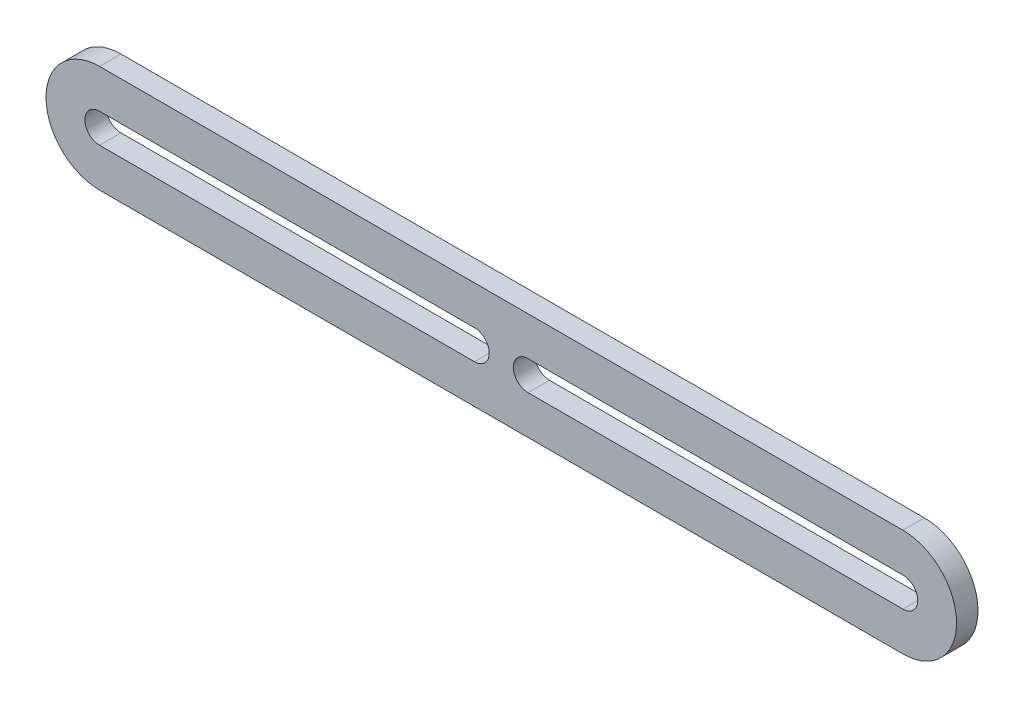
ISO-10303-21;
HEADER;
FILE_DESCRIPTION(('STEP AP214'),'2;1');
FILE_NAME('part.step','',(''),(''),'','','');
FILE_SCHEMA(('AUTOMOTIVE_DESIGN { 1 0 10303 214 1 1 1 1 }'));
ENDSEC;
DATA;
#1=APPLICATION_CONTEXT('core data for automotive mechanical design processes');
#2=APPLICATION_PROTOCOL_DEFINITION('international standard','automotive_design',2000,#1);
#3=PRODUCT_CONTEXT('',#1,'mechanical');
#4=PRODUCT('Part','Part','',(#3));
#5=PRODUCT_RELATED_PRODUCT_CATEGORY('part','',(#4));
#6=PRODUCT_DEFINITION_FORMATION('','',#4);
#7=PRODUCT_DEFINITION_CONTEXT('part definition',#1,'design');
#8=PRODUCT_DEFINITION('design','',#6,#7);
#9=PRODUCT_DEFINITION_SHAPE('','',#8);
#10=(LENGTH_UNIT() NAMED_UNIT(*) SI_UNIT(.MILLI.,.METRE.));
#11=(NAMED_UNIT(*) PLANE_ANGLE_UNIT() SI_UNIT($,.RADIAN.));
#12=(NAMED_UNIT(*) SI_UNIT($,.STERADIAN.) SOLID_ANGLE_UNIT());
#13=UNCERTAINTY_MEASURE_WITH_UNIT(LENGTH_MEASURE(1.E-05),#10,'distance_accuracy_value','');
#14=(GEOMETRIC_REPRESENTATION_CONTEXT(3) GLOBAL_UNCERTAINTY_ASSIGNED_CONTEXT((#13)) GLOBAL_UNIT_ASSIGNED_CONTEXT((#10,
#11,#12)) REPRESENTATION_CONTEXT('',''));
#15=CARTESIAN_POINT('',(0.,0.,0.));
#16=DIRECTION('',(0.,0.,1.));
#17=DIRECTION('',(1.,0.,0.));
#18=AXIS2_PLACEMENT_3D('',#15,#16,#17);
#19=CARTESIAN_POINT('',(0.,10.,4.));
#20=DIRECTION('',(0.,0.,-1.));
#21=DIRECTION('',(-1.,0.,0.));
#22=AXIS2_PLACEMENT_3D('',#19,#20,#21);
#23=PLANE('',#22);
#24=CARTESIAN_POINT('',(0.,10.,4.));
#25=DIRECTION('',(0.,0.,1.));
#26=DIRECTION('',(1.,0.,0.));
#27=AXIS2_PLACEMENT_3D('',#24,#25,#26);
#28=CIRCLE('',#27,2.75);
#29=CARTESIAN_POINT('',(0.,12.75,4.));
#30=VERTEX_POINT('',#29);
#31=CARTESIAN_POINT('',(0.,7.25,4.));
#32=VERTEX_POINT('',#31);
#33=EDGE_CURVE('E180',#30,#32,#28,.T.);
#34=ORIENTED_EDGE('',*,*,#33,.F.);
#35=DIRECTION('',(-1.,0.,0.));
#36=VECTOR('',#35,1.);
#37=CARTESIAN_POINT('',(0.,12.75,4.));
#38=LINE('',#37,#36);
#39=CARTESIAN_POINT('',(70.,12.75,4.));
#40=VERTEX_POINT('',#39);
#41=EDGE_CURVE('E191',#40,#30,#38,.T.);
#42=ORIENTED_EDGE('',*,*,#41,.F.);
#43=CARTESIAN_POINT('',(70.,10.,4.));
#44=DIRECTION('',(0.,0.,1.));
#45=DIRECTION('',(1.,0.,0.));
#46=AXIS2_PLACEMENT_3D('',#43,#44,#45);
#47=CIRCLE('',#46,2.74999999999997);
#48=CARTESIAN_POINT('',(70.,7.25000000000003,4.));
#49=VERTEX_POINT('',#48);
#50=EDGE_CURVE('E187',#49,#40,#47,.T.);
#51=ORIENTED_EDGE('',*,*,#50,.F.);
#52=DIRECTION('',(1.,0.,0.));
#53=VECTOR('',#52,1.);
#54=CARTESIAN_POINT('',(0.,7.25,4.));
#55=LINE('',#54,#53);
#56=EDGE_CURVE('E183',#32,#49,#55,.T.);
#57=ORIENTED_EDGE('',*,*,#56,.F.);
#58=EDGE_LOOP('',(#34,#42,#51,#57));
#59=FACE_BOUND('',#58,.T.);
#60=CARTESIAN_POINT('',(0.,10.,4.));
#61=DIRECTION('',(0.,0.,1.));
#62=DIRECTION('',(-1.,0.,0.));
#63=AXIS2_PLACEMENT_3D('',#60,#61,#62);
#64=CIRCLE('',#63,10.);
#65=CARTESIAN_POINT('',(0.,20.,4.));
#66=VERTEX_POINT('',#65);
#67=CARTESIAN_POINT('',(0.,0.,4.));
#68=VERTEX_POINT('',#67);
#69=EDGE_CURVE('E223',#66,#68,#64,.T.);
#70=ORIENTED_EDGE('',*,*,#69,.T.);
#71=DIRECTION('',(1.,0.,0.));
#72=VECTOR('',#71,1.);
#73=CARTESIAN_POINT('',(0.,0.,4.));
#74=LINE('',#73,#72);
#75=CARTESIAN_POINT('',(150.,0.,4.));
#76=VERTEX_POINT('',#75);
#77=EDGE_CURVE('E227',#68,#76,#74,.T.);
#78=ORIENTED_EDGE('',*,*,#77,.T.);
#79=CARTESIAN_POINT('',(150.,10.,4.));
#80=DIRECTION('',(0.,0.,1.));
#81=DIRECTION('',(-1.,0.,0.));
#82=AXIS2_PLACEMENT_3D('',#79,#80,#81);
#83=CIRCLE('',#82,10.);
#84=CARTESIAN_POINT('',(150.,20.,4.));
#85=VERTEX_POINT('',#84);
#86=EDGE_CURVE('E231',#76,#85,#83,.T.);
#87=ORIENTED_EDGE('',*,*,#86,.T.);
#88=DIRECTION('',(-1.,0.,0.));
#89=VECTOR('',#88,1.);
#90=CARTESIAN_POINT('',(0.,20.,4.));
#91=LINE('',#90,#89);
#92=EDGE_CURVE('E234',#85,#66,#91,.T.);
#93=ORIENTED_EDGE('',*,*,#92,.T.);
#94=EDGE_LOOP('',(#70,#78,#87,#93));
#95=FACE_BOUND('',#94,.T.);
#96=CARTESIAN_POINT('',(150.,10.,4.));
#97=DIRECTION('',(0.,0.,1.));
#98=DIRECTION('',(-1.,0.,0.));
#99=AXIS2_PLACEMENT_3D('',#96,#97,#98);
#100=CIRCLE('',#99,2.74999999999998);
#101=CARTESIAN_POINT('',(150.,7.25000000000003,4.));
#102=VERTEX_POINT('',#101);
#103=CARTESIAN_POINT('',(150.,12.75,4.));
#104=VERTEX_POINT('',#103);
#105=EDGE_CURVE('E132',#102,#104,#100,.T.);
#106=ORIENTED_EDGE('',*,*,#105,.F.);
#107=DIRECTION('',(1.,0.,0.));
#108=VECTOR('',#107,1.);
#109=CARTESIAN_POINT('',(150.,7.25000000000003,4.));
#110=LINE('',#109,#108);
#111=CARTESIAN_POINT('',(80.,7.25000000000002,4.));
#112=VERTEX_POINT('',#111);
#113=EDGE_CURVE('E158',#112,#102,#110,.T.);
#114=ORIENTED_EDGE('',*,*,#113,.F.);
#115=CARTESIAN_POINT('',(80.,10.,4.));
#116=DIRECTION('',(0.,0.,1.));
#117=DIRECTION('',(-1.,0.,0.));
#118=AXIS2_PLACEMENT_3D('',#115,#116,#117);
#119=CIRCLE('',#118,2.74999999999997);
#120=CARTESIAN_POINT('',(80.,12.75,4.));
#121=VERTEX_POINT('',#120);
#122=EDGE_CURVE('E154',#121,#112,#119,.T.);
#123=ORIENTED_EDGE('',*,*,#122,.F.);
#124=DIRECTION('',(-1.,0.,0.));
#125=VECTOR('',#124,1.);
#126=CARTESIAN_POINT('',(150.,12.75,4.));
#127=LINE('',#126,#125);
#128=EDGE_CURVE('E141',#104,#121,#127,.T.);
#129=ORIENTED_EDGE('',*,*,#128,.F.);
#130=EDGE_LOOP('',(#106,#114,#123,#129));
#131=FACE_BOUND('',#130,.T.);
#132=ADVANCED_FACE('F42',(#59,#95,#131),#23,.F.);
#133=CARTESIAN_POINT('',(0.,10.,0.));
#134=DIRECTION('',(0.,0.,-1.));
#135=DIRECTION('',(-1.,0.,0.));
#136=AXIS2_PLACEMENT_3D('',#133,#134,#135);
#137=PLANE('',#136);
#138=CARTESIAN_POINT('',(0.,10.,0.));
#139=DIRECTION('',(0.,0.,1.));
#140=DIRECTION('',(-1.,0.,0.));
#141=AXIS2_PLACEMENT_3D('',#138,#139,#140);
#142=CIRCLE('',#141,10.);
#143=CARTESIAN_POINT('',(0.,20.,0.));
#144=VERTEX_POINT('',#143);
#145=CARTESIAN_POINT('',(0.,0.,0.));
#146=VERTEX_POINT('',#145);
#147=EDGE_CURVE('E222',#144,#146,#142,.T.);
#148=ORIENTED_EDGE('',*,*,#147,.F.);
#149=DIRECTION('',(-1.,0.,0.));
#150=VECTOR('',#149,1.);
#151=CARTESIAN_POINT('',(0.,20.,0.));
#152=LINE('',#151,#150);
#153=CARTESIAN_POINT('',(150.,20.,0.));
#154=VERTEX_POINT('',#153);
#155=EDGE_CURVE('E228',#154,#144,#152,.T.);
#156=ORIENTED_EDGE('',*,*,#155,.F.);
#157=CARTESIAN_POINT('',(150.,10.,0.));
#158=DIRECTION('',(0.,0.,1.));
#159=DIRECTION('',(-1.,0.,0.));
#160=AXIS2_PLACEMENT_3D('',#157,#158,#159);
#161=CIRCLE('',#160,10.);
#162=CARTESIAN_POINT('',(150.,0.,0.));
#163=VERTEX_POINT('',#162);
#164=EDGE_CURVE('E244',#163,#154,#161,.T.);
#165=ORIENTED_EDGE('',*,*,#164,.F.);
#166=DIRECTION('',(1.,0.,0.));
#167=VECTOR('',#166,1.);
#168=CARTESIAN_POINT('',(0.,0.,0.));
#169=LINE('',#168,#167);
#170=EDGE_CURVE('E241',#146,#163,#169,.T.);
#171=ORIENTED_EDGE('',*,*,#170,.F.);
#172=EDGE_LOOP('',(#148,#156,#165,#171));
#173=FACE_BOUND('',#172,.T.);
#174=DIRECTION('',(-1.,0.,0.));
#175=VECTOR('',#174,1.);
#176=CARTESIAN_POINT('',(0.,12.75,0.));
#177=LINE('',#176,#175);
#178=CARTESIAN_POINT('',(70.,12.75,0.));
#179=VERTEX_POINT('',#178);
#180=CARTESIAN_POINT('',(0.,12.75,0.));
#181=VERTEX_POINT('',#180);
#182=EDGE_CURVE('E184',#179,#181,#177,.T.);
#183=ORIENTED_EDGE('',*,*,#182,.T.);
#184=CARTESIAN_POINT('',(0.,10.,0.));
#185=DIRECTION('',(0.,0.,1.));
#186=DIRECTION('',(1.,0.,0.));
#187=AXIS2_PLACEMENT_3D('',#184,#185,#186);
#188=CIRCLE('',#187,2.75);
#189=CARTESIAN_POINT('',(0.,7.25,0.));
#190=VERTEX_POINT('',#189);
#191=EDGE_CURVE('E150',#181,#190,#188,.T.);
#192=ORIENTED_EDGE('',*,*,#191,.T.);
#193=DIRECTION('',(1.,0.,0.));
#194=VECTOR('',#193,1.);
#195=CARTESIAN_POINT('',(0.,7.25,0.));
#196=LINE('',#195,#194);
#197=CARTESIAN_POINT('',(70.,7.25000000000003,0.));
#198=VERTEX_POINT('',#197);
#199=EDGE_CURVE('E198',#190,#198,#196,.T.);
#200=ORIENTED_EDGE('',*,*,#199,.T.);
#201=CARTESIAN_POINT('',(70.,10.,0.));
#202=DIRECTION('',(0.,0.,1.));
#203=DIRECTION('',(1.,0.,0.));
#204=AXIS2_PLACEMENT_3D('',#201,#202,#203);
#205=CIRCLE('',#204,2.74999999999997);
#206=EDGE_CURVE('E202',#198,#179,#205,.T.);
#207=ORIENTED_EDGE('',*,*,#206,.T.);
#208=EDGE_LOOP('',(#183,#192,#200,#207));
#209=FACE_BOUND('',#208,.T.);
#210=DIRECTION('',(1.,0.,0.));
#211=VECTOR('',#210,1.);
#212=CARTESIAN_POINT('',(150.,7.25000000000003,0.));
#213=LINE('',#212,#211);
#214=CARTESIAN_POINT('',(80.,7.25000000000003,0.));
#215=VERTEX_POINT('',#214);
#216=CARTESIAN_POINT('',(150.,7.25000000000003,0.));
#217=VERTEX_POINT('',#216);
#218=EDGE_CURVE('E142',#215,#217,#213,.T.);
#219=ORIENTED_EDGE('',*,*,#218,.T.);
#220=CARTESIAN_POINT('',(150.,10.,0.));
#221=DIRECTION('',(0.,0.,1.));
#222=DIRECTION('',(-1.,0.,0.));
#223=AXIS2_PLACEMENT_3D('',#220,#221,#222);
#224=CIRCLE('',#223,2.74999999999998);
#225=CARTESIAN_POINT('',(150.,12.75,0.));
#226=VERTEX_POINT('',#225);
#227=EDGE_CURVE('E66',#217,#226,#224,.T.);
#228=ORIENTED_EDGE('',*,*,#227,.T.);
#229=DIRECTION('',(-1.,0.,0.));
#230=VECTOR('',#229,1.);
#231=CARTESIAN_POINT('',(150.,12.75,0.));
#232=LINE('',#231,#230);
#233=CARTESIAN_POINT('',(80.,12.75,0.));
#234=VERTEX_POINT('',#233);
#235=EDGE_CURVE('E148',#226,#234,#232,.T.);
#236=ORIENTED_EDGE('',*,*,#235,.T.);
#237=CARTESIAN_POINT('',(80.,10.,0.));
#238=DIRECTION('',(0.,0.,1.));
#239=DIRECTION('',(-1.,0.,0.));
#240=AXIS2_PLACEMENT_3D('',#237,#238,#239);
#241=CIRCLE('',#240,2.74999999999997);
#242=EDGE_CURVE('E167',#234,#215,#241,.T.);
#243=ORIENTED_EDGE('',*,*,#242,.T.);
#244=EDGE_LOOP('',(#219,#228,#236,#243));
#245=FACE_BOUND('',#244,.T.);
#246=ADVANCED_FACE('F267',(#173,#209,#245),#137,.T.);
#247=CARTESIAN_POINT('',(0.,10.,4.));
#248=DIRECTION('',(0.,0.,-1.));
#249=DIRECTION('',(-1.,0.,0.));
#250=AXIS2_PLACEMENT_3D('',#247,#248,#249);
#251=CYLINDRICAL_SURFACE('',#250,10.);
#252=ORIENTED_EDGE('',*,*,#147,.T.);
#253=DIRECTION('',(0.,0.,-1.));
#254=VECTOR('',#253,1.);
#255=CARTESIAN_POINT('',(0.,0.,4.));
#256=LINE('',#255,#254);
#257=EDGE_CURVE('E11',#68,#146,#256,.T.);
#258=ORIENTED_EDGE('',*,*,#257,.F.);
#259=ORIENTED_EDGE('',*,*,#69,.F.);
#260=DIRECTION('',(0.,0.,-1.));
#261=VECTOR('',#260,1.);
#262=CARTESIAN_POINT('',(0.,20.,4.));
#263=LINE('',#262,#261);
#264=EDGE_CURVE('E237',#66,#144,#263,.T.);
#265=ORIENTED_EDGE('',*,*,#264,.T.);
#266=EDGE_LOOP('',(#252,#258,#259,#265));
#267=FACE_BOUND('',#266,.T.);
#268=ADVANCED_FACE('F44',(#267),#251,.T.);
#269=CARTESIAN_POINT('',(0.,0.,4.));
#270=DIRECTION('',(0.,1.,0.));
#271=DIRECTION('',(0.,0.,1.));
#272=AXIS2_PLACEMENT_3D('',#269,#270,#271);
#273=PLANE('',#272);
#274=ORIENTED_EDGE('',*,*,#170,.T.);
#275=DIRECTION('',(0.,0.,-1.));
#276=VECTOR('',#275,1.);
#277=CARTESIAN_POINT('',(150.,0.,4.));
#278=LINE('',#277,#276);
#279=EDGE_CURVE('E51',#76,#163,#278,.T.);
#280=ORIENTED_EDGE('',*,*,#279,.F.);
#281=ORIENTED_EDGE('',*,*,#77,.F.);
#282=ORIENTED_EDGE('',*,*,#257,.T.);
#283=EDGE_LOOP('',(#274,#280,#281,#282));
#284=FACE_BOUND('',#283,.T.);
#285=ADVANCED_FACE('F277',(#284),#273,.F.);
#286=CARTESIAN_POINT('',(150.,10.,4.));
#287=DIRECTION('',(0.,0.,-1.));
#288=DIRECTION('',(-1.,0.,0.));
#289=AXIS2_PLACEMENT_3D('',#286,#287,#288);
#290=CYLINDRICAL_SURFACE('',#289,10.);
#291=ORIENTED_EDGE('',*,*,#164,.T.);
#292=DIRECTION('',(0.,0.,-1.));
#293=VECTOR('',#292,1.);
#294=CARTESIAN_POINT('',(150.,20.,4.));
#295=LINE('',#294,#293);
#296=EDGE_CURVE('E252',#85,#154,#295,.T.);
#297=ORIENTED_EDGE('',*,*,#296,.F.);
#298=ORIENTED_EDGE('',*,*,#86,.F.);
#299=ORIENTED_EDGE('',*,*,#279,.T.);
#300=EDGE_LOOP('',(#291,#297,#298,#299));
#301=FACE_BOUND('',#300,.T.);
#302=ADVANCED_FACE('F261',(#301),#290,.T.);
#303=CARTESIAN_POINT('',(0.,20.,4.));
#304=DIRECTION('',(0.,-1.,0.));
#305=DIRECTION('',(1.,0.,0.));
#306=AXIS2_PLACEMENT_3D('',#303,#304,#305);
#307=PLANE('',#306);
#308=ORIENTED_EDGE('',*,*,#155,.T.);
#309=ORIENTED_EDGE('',*,*,#264,.F.);
#310=ORIENTED_EDGE('',*,*,#92,.F.);
#311=ORIENTED_EDGE('',*,*,#296,.T.);
#312=EDGE_LOOP('',(#308,#309,#310,#311));
#313=FACE_BOUND('',#312,.T.);
#314=ADVANCED_FACE('F271',(#313),#307,.F.);
#315=CARTESIAN_POINT('',(0.,10.,4.));
#316=DIRECTION('',(0.,0.,-1.));
#317=DIRECTION('',(-1.,0.,0.));
#318=AXIS2_PLACEMENT_3D('',#315,#316,#317);
#319=CYLINDRICAL_SURFACE('',#318,2.75);
#320=ORIENTED_EDGE('',*,*,#191,.F.);
#321=DIRECTION('',(0.,0.,-1.));
#322=VECTOR('',#321,1.);
#323=CARTESIAN_POINT('',(0.,12.75,4.));
#324=LINE('',#323,#322);
#325=EDGE_CURVE('E194',#30,#181,#324,.T.);
#326=ORIENTED_EDGE('',*,*,#325,.F.);
#327=ORIENTED_EDGE('',*,*,#33,.T.);
#328=DIRECTION('',(0.,0.,-1.));
#329=VECTOR('',#328,1.);
#330=CARTESIAN_POINT('',(0.,7.25,4.));
#331=LINE('',#330,#329);
#332=EDGE_CURVE('E218',#32,#190,#331,.T.);
#333=ORIENTED_EDGE('',*,*,#332,.T.);
#334=EDGE_LOOP('',(#320,#326,#327,#333));
#335=FACE_BOUND('',#334,.T.);
#336=ADVANCED_FACE('F293',(#335),#319,.F.);
#337=CARTESIAN_POINT('',(0.,7.25,4.));
#338=DIRECTION('',(0.,1.,0.));
#339=DIRECTION('',(-1.,0.,0.));
#340=AXIS2_PLACEMENT_3D('',#337,#338,#339);
#341=PLANE('',#340);
#342=ORIENTED_EDGE('',*,*,#199,.F.);
#343=ORIENTED_EDGE('',*,*,#332,.F.);
#344=ORIENTED_EDGE('',*,*,#56,.T.);
#345=DIRECTION('',(0.,0.,-1.));
#346=VECTOR('',#345,1.);
#347=CARTESIAN_POINT('',(70.,7.25000000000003,4.));
#348=LINE('',#347,#346);
#349=EDGE_CURVE('E215',#49,#198,#348,.T.);
#350=ORIENTED_EDGE('',*,*,#349,.T.);
#351=EDGE_LOOP('',(#342,#343,#344,#350));
#352=FACE_BOUND('',#351,.T.);
#353=ADVANCED_FACE('F300',(#352),#341,.T.);
#354=CARTESIAN_POINT('',(70.,10.,4.));
#355=DIRECTION('',(0.,0.,-1.));
#356=DIRECTION('',(-1.,0.,0.));
#357=AXIS2_PLACEMENT_3D('',#354,#355,#356);
#358=CYLINDRICAL_SURFACE('',#357,2.74999999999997);
#359=ORIENTED_EDGE('',*,*,#206,.F.);
#360=ORIENTED_EDGE('',*,*,#349,.F.);
#361=ORIENTED_EDGE('',*,*,#50,.T.);
#362=DIRECTION('',(0.,0.,-1.));
#363=VECTOR('',#362,1.);
#364=CARTESIAN_POINT('',(70.,12.75,4.));
#365=LINE('',#364,#363);
#366=EDGE_CURVE('E212',#40,#179,#365,.T.);
#367=ORIENTED_EDGE('',*,*,#366,.T.);
#368=EDGE_LOOP('',(#359,#360,#361,#367));
#369=FACE_BOUND('',#368,.T.);
#370=ADVANCED_FACE('F305',(#369),#358,.F.);
#371=CARTESIAN_POINT('',(0.,12.75,4.));
#372=DIRECTION('',(0.,-1.,0.));
#373=DIRECTION('',(1.,0.,0.));
#374=AXIS2_PLACEMENT_3D('',#371,#372,#373);
#375=PLANE('',#374);
#376=ORIENTED_EDGE('',*,*,#182,.F.);
#377=ORIENTED_EDGE('',*,*,#366,.F.);
#378=ORIENTED_EDGE('',*,*,#41,.T.);
#379=ORIENTED_EDGE('',*,*,#325,.T.);
#380=EDGE_LOOP('',(#376,#377,#378,#379));
#381=FACE_BOUND('',#380,.T.);
#382=ADVANCED_FACE('F311',(#381),#375,.T.);
#383=CARTESIAN_POINT('',(150.,10.,4.));
#384=DIRECTION('',(0.,0.,-1.));
#385=DIRECTION('',(-1.,0.,0.));
#386=AXIS2_PLACEMENT_3D('',#383,#384,#385);
#387=CYLINDRICAL_SURFACE('',#386,2.74999999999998);
#388=ORIENTED_EDGE('',*,*,#227,.F.);
#389=DIRECTION('',(0.,0.,-1.));
#390=VECTOR('',#389,1.);
#391=CARTESIAN_POINT('',(150.,7.25000000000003,4.));
#392=LINE('',#391,#390);
#393=EDGE_CURVE('E136',#102,#217,#392,.T.);
#394=ORIENTED_EDGE('',*,*,#393,.F.);
#395=ORIENTED_EDGE('',*,*,#105,.T.);
#396=DIRECTION('',(0.,0.,-1.));
#397=VECTOR('',#396,1.);
#398=CARTESIAN_POINT('',(150.,12.75,4.));
#399=LINE('',#398,#397);
#400=EDGE_CURVE('E135',#104,#226,#399,.T.);
#401=ORIENTED_EDGE('',*,*,#400,.T.);
#402=EDGE_LOOP('',(#388,#394,#395,#401));
#403=FACE_BOUND('',#402,.T.);
#404=ADVANCED_FACE('F134',(#403),#387,.F.);
#405=CARTESIAN_POINT('',(150.,12.75,4.));
#406=DIRECTION('',(0.,-1.,0.));
#407=DIRECTION('',(1.,0.,0.));
#408=AXIS2_PLACEMENT_3D('',#405,#406,#407);
#409=PLANE('',#408);
#410=ORIENTED_EDGE('',*,*,#235,.F.);
#411=ORIENTED_EDGE('',*,*,#400,.F.);
#412=ORIENTED_EDGE('',*,*,#128,.T.);
#413=DIRECTION('',(0.,0.,-1.));
#414=VECTOR('',#413,1.);
#415=CARTESIAN_POINT('',(80.,12.75,4.));
#416=LINE('',#415,#414);
#417=EDGE_CURVE('E151',#121,#234,#416,.T.);
#418=ORIENTED_EDGE('',*,*,#417,.T.);
#419=EDGE_LOOP('',(#410,#411,#412,#418));
#420=FACE_BOUND('',#419,.T.);
#421=ADVANCED_FACE('F145',(#420),#409,.T.);
#422=CARTESIAN_POINT('',(80.,10.,4.));
#423=DIRECTION('',(0.,0.,-1.));
#424=DIRECTION('',(-1.,0.,0.));
#425=AXIS2_PLACEMENT_3D('',#422,#423,#424);
#426=CYLINDRICAL_SURFACE('',#425,2.74999999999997);
#427=ORIENTED_EDGE('',*,*,#242,.F.);
#428=ORIENTED_EDGE('',*,*,#417,.F.);
#429=ORIENTED_EDGE('',*,*,#122,.T.);
#430=DIRECTION('',(0.,0.,-1.));
#431=VECTOR('',#430,1.);
#432=CARTESIAN_POINT('',(80.,7.25000000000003,4.));
#433=LINE('',#432,#431);
#434=EDGE_CURVE('E58',#112,#215,#433,.T.);
#435=ORIENTED_EDGE('',*,*,#434,.T.);
#436=EDGE_LOOP('',(#427,#428,#429,#435));
#437=FACE_BOUND('',#436,.T.);
#438=ADVANCED_FACE('F330',(#437),#426,.F.);
#439=CARTESIAN_POINT('',(150.,7.25000000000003,4.));
#440=DIRECTION('',(0.,1.,0.));
#441=DIRECTION('',(-1.,0.,0.));
#442=AXIS2_PLACEMENT_3D('',#439,#440,#441);
#443=PLANE('',#442);
#444=ORIENTED_EDGE('',*,*,#218,.F.);
#445=ORIENTED_EDGE('',*,*,#434,.F.);
#446=ORIENTED_EDGE('',*,*,#113,.T.);
#447=ORIENTED_EDGE('',*,*,#393,.T.);
#448=EDGE_LOOP('',(#444,#445,#446,#447));
#449=FACE_BOUND('',#448,.T.);
#450=ADVANCED_FACE('F333',(#449),#443,.T.);
#451=CLOSED_SHELL('',(#132,#246,#268,#285,#302,#314,#336,#353,#370,#382,#404,#421,#438,#450));
#452=MANIFOLD_SOLID_BREP('B2',#451);
#453=ADVANCED_BREP_SHAPE_REPRESENTATION('',(#18,#452),#14);
#454=SHAPE_DEFINITION_REPRESENTATION(#9,#453);
ENDSEC;
END-ISO-10303-21;
